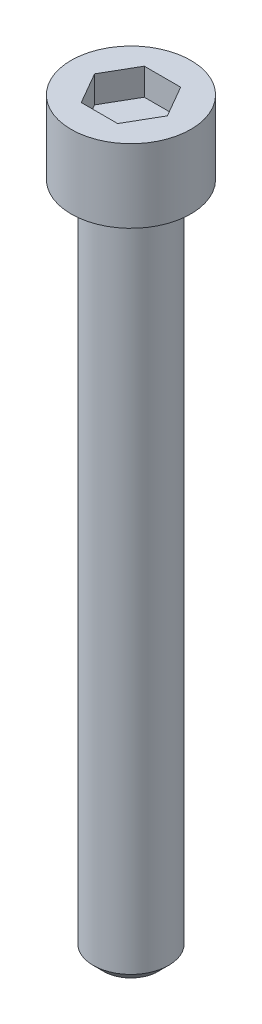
ISO-10303-21;
HEADER;
FILE_DESCRIPTION(('STEP AP214'),'2;1');
FILE_NAME('part.step','',(''),(''),'','','');
FILE_SCHEMA(('AUTOMOTIVE_DESIGN { 1 0 10303 214 1 1 1 1 }'));
ENDSEC;
DATA;
#1=APPLICATION_CONTEXT('core data for automotive mechanical design processes');
#2=APPLICATION_PROTOCOL_DEFINITION('international standard','automotive_design',2000,#1);
#3=PRODUCT_CONTEXT('',#1,'mechanical');
#4=PRODUCT('Part','Part','',(#3));
#5=PRODUCT_RELATED_PRODUCT_CATEGORY('part','',(#4));
#6=PRODUCT_DEFINITION_FORMATION('','',#4);
#7=PRODUCT_DEFINITION_CONTEXT('part definition',#1,'design');
#8=PRODUCT_DEFINITION('design','',#6,#7);
#9=PRODUCT_DEFINITION_SHAPE('','',#8);
#10=(LENGTH_UNIT() NAMED_UNIT(*) SI_UNIT(.MILLI.,.METRE.));
#11=(NAMED_UNIT(*) PLANE_ANGLE_UNIT() SI_UNIT($,.RADIAN.));
#12=(NAMED_UNIT(*) SI_UNIT($,.STERADIAN.) SOLID_ANGLE_UNIT());
#13=UNCERTAINTY_MEASURE_WITH_UNIT(LENGTH_MEASURE(1.E-05),#10,'distance_accuracy_value','');
#14=(GEOMETRIC_REPRESENTATION_CONTEXT(3) GLOBAL_UNCERTAINTY_ASSIGNED_CONTEXT((#13)) GLOBAL_UNIT_ASSIGNED_CONTEXT((#10,
#11,#12)) REPRESENTATION_CONTEXT('',''));
#15=CARTESIAN_POINT('',(0.,0.,0.));
#16=DIRECTION('',(0.,0.,1.));
#17=DIRECTION('',(1.,0.,0.));
#18=AXIS2_PLACEMENT_3D('',#15,#16,#17);
#19=CARTESIAN_POINT('',(0.,2.7686,0.));
#20=DIRECTION('',(0.,-1.,0.));
#21=DIRECTION('',(0.,0.,-1.));
#22=AXIS2_PLACEMENT_3D('',#19,#20,#21);
#23=PLANE('',#22);
#24=DIRECTION('',(-0.5,0.,-0.866025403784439));
#25=VECTOR('',#24,1.);
#26=CARTESIAN_POINT('',(1.3748153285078,2.7686,0.));
#27=LINE('',#26,#25);
#28=CARTESIAN_POINT('',(1.3748153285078,2.7686,0.));
#29=VERTEX_POINT('',#28);
#30=CARTESIAN_POINT('',(0.687407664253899,2.7686,-1.190625));
#31=VERTEX_POINT('',#30);
#32=EDGE_CURVE('E118',#29,#31,#27,.T.);
#33=ORIENTED_EDGE('',*,*,#32,.F.);
#34=DIRECTION('',(0.5,0.,-0.866025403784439));
#35=VECTOR('',#34,1.);
#36=CARTESIAN_POINT('',(0.687407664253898,2.7686,1.190625));
#37=LINE('',#36,#35);
#38=CARTESIAN_POINT('',(0.687407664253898,2.7686,1.190625));
#39=VERTEX_POINT('',#38);
#40=EDGE_CURVE('E44',#39,#29,#37,.T.);
#41=ORIENTED_EDGE('',*,*,#40,.F.);
#42=DIRECTION('',(1.,0.,0.));
#43=VECTOR('',#42,1.);
#44=CARTESIAN_POINT('',(-0.687407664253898,2.7686,1.190625));
#45=LINE('',#44,#43);
#46=CARTESIAN_POINT('',(-0.687407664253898,2.7686,1.190625));
#47=VERTEX_POINT('',#46);
#48=EDGE_CURVE('E127',#47,#39,#45,.T.);
#49=ORIENTED_EDGE('',*,*,#48,.F.);
#50=DIRECTION('',(0.5,0.,0.866025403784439));
#51=VECTOR('',#50,1.);
#52=CARTESIAN_POINT('',(-1.3748153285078,2.7686,0.));
#53=LINE('',#52,#51);
#54=CARTESIAN_POINT('',(-1.3748153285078,2.7686,0.));
#55=VERTEX_POINT('',#54);
#56=EDGE_CURVE('E125',#55,#47,#53,.T.);
#57=ORIENTED_EDGE('',*,*,#56,.F.);
#58=DIRECTION('',(-0.5,0.,0.866025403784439));
#59=VECTOR('',#58,1.);
#60=CARTESIAN_POINT('',(-0.687407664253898,2.7686,-1.190625));
#61=LINE('',#60,#59);
#62=CARTESIAN_POINT('',(-0.687407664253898,2.7686,-1.190625));
#63=VERTEX_POINT('',#62);
#64=EDGE_CURVE('E92',#63,#55,#61,.T.);
#65=ORIENTED_EDGE('',*,*,#64,.F.);
#66=DIRECTION('',(-1.,0.,0.));
#67=VECTOR('',#66,1.);
#68=CARTESIAN_POINT('',(0.687407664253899,2.7686,-1.190625));
#69=LINE('',#68,#67);
#70=EDGE_CURVE('E121',#31,#63,#69,.T.);
#71=ORIENTED_EDGE('',*,*,#70,.F.);
#72=EDGE_LOOP('',(#33,#41,#49,#57,#65,#71));
#73=FACE_BOUND('',#72,.T.);
#74=CARTESIAN_POINT('',(0.,2.7686,0.));
#75=DIRECTION('',(0.,1.,0.));
#76=DIRECTION('',(0.,0.,1.));
#77=AXIS2_PLACEMENT_3D('',#74,#75,#76);
#78=CIRCLE('',#77,2.2606);
#79=CARTESIAN_POINT('',(0.,2.7686,2.2606));
#80=VERTEX_POINT('',#79);
#81=EDGE_CURVE('E11',#80,#80,#78,.T.);
#82=ORIENTED_EDGE('',*,*,#81,.T.);
#83=EDGE_LOOP('',(#82));
#84=FACE_BOUND('',#83,.T.);
#85=ADVANCED_FACE('F30',(#73,#84),#23,.F.);
#86=CARTESIAN_POINT('',(0.,17.272,0.));
#87=DIRECTION('',(0.,1.,0.));
#88=DIRECTION('',(0.,0.,1.));
#89=AXIS2_PLACEMENT_3D('',#86,#87,#88);
#90=CYLINDRICAL_SURFACE('',#89,2.2606);
#91=ORIENTED_EDGE('',*,*,#81,.F.);
#92=EDGE_LOOP('',(#91));
#93=FACE_BOUND('',#92,.T.);
#94=CARTESIAN_POINT('',(0.,0.,0.));
#95=DIRECTION('',(0.,1.,0.));
#96=DIRECTION('',(0.,0.,1.));
#97=AXIS2_PLACEMENT_3D('',#94,#95,#96);
#98=CIRCLE('',#97,2.2606);
#99=CARTESIAN_POINT('',(0.,0.,2.2606));
#100=VERTEX_POINT('',#99);
#101=EDGE_CURVE('E37',#100,#100,#98,.T.);
#102=ORIENTED_EDGE('',*,*,#101,.T.);
#103=EDGE_LOOP('',(#102));
#104=FACE_BOUND('',#103,.T.);
#105=ADVANCED_FACE('F147',(#93,#104),#90,.T.);
#106=CARTESIAN_POINT('',(2.2606,0.,0.));
#107=DIRECTION('',(0.,1.,0.));
#108=DIRECTION('',(0.,0.,1.));
#109=AXIS2_PLACEMENT_3D('',#106,#107,#108);
#110=PLANE('',#109);
#111=ORIENTED_EDGE('',*,*,#101,.F.);
#112=EDGE_LOOP('',(#111));
#113=FACE_BOUND('',#112,.T.);
#114=CARTESIAN_POINT('',(0.,0.,0.));
#115=DIRECTION('',(0.,1.,0.));
#116=DIRECTION('',(0.,0.,1.));
#117=AXIS2_PLACEMENT_3D('',#114,#115,#116);
#118=CIRCLE('',#117,1.4224);
#119=CARTESIAN_POINT('',(0.,0.,1.4224));
#120=VERTEX_POINT('',#119);
#121=EDGE_CURVE('E142',#120,#120,#118,.T.);
#122=ORIENTED_EDGE('',*,*,#121,.T.);
#123=EDGE_LOOP('',(#122));
#124=FACE_BOUND('',#123,.T.);
#125=ADVANCED_FACE('F149',(#113,#124),#110,.F.);
#126=CARTESIAN_POINT('',(0.,17.272,0.));
#127=DIRECTION('',(0.,1.,0.));
#128=DIRECTION('',(0.,0.,1.));
#129=AXIS2_PLACEMENT_3D('',#126,#127,#128);
#130=CYLINDRICAL_SURFACE('',#129,1.4224);
#131=ORIENTED_EDGE('',*,*,#121,.F.);
#132=EDGE_LOOP('',(#131));
#133=FACE_BOUND('',#132,.T.);
#134=CARTESIAN_POINT('',(0.,-25.003125,0.));
#135=DIRECTION('',(0.,1.,0.));
#136=DIRECTION('',(0.,0.,1.));
#137=AXIS2_PLACEMENT_3D('',#134,#135,#136);
#138=CIRCLE('',#137,1.42240000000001);
#139=CARTESIAN_POINT('',(0.,-25.003125,1.42240000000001));
#140=VERTEX_POINT('',#139);
#141=EDGE_CURVE('E139',#140,#140,#138,.T.);
#142=ORIENTED_EDGE('',*,*,#141,.T.);
#143=EDGE_LOOP('',(#142));
#144=FACE_BOUND('',#143,.T.);
#145=ADVANCED_FACE('F152',(#133,#144),#130,.T.);
#146=CARTESIAN_POINT('',(0.,-25.4,0.));
#147=DIRECTION('',(0.,1.,0.));
#148=DIRECTION('',(0.,0.,1.));
#149=AXIS2_PLACEMENT_3D('',#146,#147,#148);
#150=CONICAL_SURFACE('',#149,1.02552500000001,0.785398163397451);
#151=ORIENTED_EDGE('',*,*,#141,.F.);
#152=EDGE_LOOP('',(#151));
#153=FACE_BOUND('',#152,.T.);
#154=CARTESIAN_POINT('',(0.,-25.4,0.));
#155=DIRECTION('',(0.,1.,0.));
#156=DIRECTION('',(0.,0.,1.));
#157=AXIS2_PLACEMENT_3D('',#154,#155,#156);
#158=CIRCLE('',#157,1.02552500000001);
#159=CARTESIAN_POINT('',(0.,-25.4,1.02552500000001));
#160=VERTEX_POINT('',#159);
#161=EDGE_CURVE('E131',#160,#160,#158,.T.);
#162=ORIENTED_EDGE('',*,*,#161,.T.);
#163=EDGE_LOOP('',(#162));
#164=FACE_BOUND('',#163,.T.);
#165=ADVANCED_FACE('F158',(#153,#164),#150,.T.);
#166=CARTESIAN_POINT('',(1.02552500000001,-25.4,0.));
#167=DIRECTION('',(0.,1.,0.));
#168=DIRECTION('',(0.,0.,1.));
#169=AXIS2_PLACEMENT_3D('',#166,#167,#168);
#170=PLANE('',#169);
#171=ORIENTED_EDGE('',*,*,#161,.F.);
#172=EDGE_LOOP('',(#171));
#173=FACE_BOUND('',#172,.T.);
#174=ADVANCED_FACE('F164',(#173),#170,.F.);
#175=CARTESIAN_POINT('',(0.687407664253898,1.7526,1.190625));
#176=DIRECTION('',(0.866025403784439,0.,0.5));
#177=DIRECTION('',(0.5,0.,-0.866025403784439));
#178=AXIS2_PLACEMENT_3D('',#175,#176,#177);
#179=PLANE('',#178);
#180=ORIENTED_EDGE('',*,*,#40,.T.);
#181=DIRECTION('',(0.,1.,0.));
#182=VECTOR('',#181,1.);
#183=CARTESIAN_POINT('',(1.3748153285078,1.7526,0.));
#184=LINE('',#183,#182);
#185=CARTESIAN_POINT('',(1.3748153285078,1.7526,0.));
#186=VERTEX_POINT('',#185);
#187=EDGE_CURVE('E74',#186,#29,#184,.T.);
#188=ORIENTED_EDGE('',*,*,#187,.F.);
#189=DIRECTION('',(0.5,0.,-0.866025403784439));
#190=VECTOR('',#189,1.);
#191=CARTESIAN_POINT('',(0.687407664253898,1.7526,1.190625));
#192=LINE('',#191,#190);
#193=CARTESIAN_POINT('',(0.687407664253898,1.7526,1.190625));
#194=VERTEX_POINT('',#193);
#195=EDGE_CURVE('E129',#194,#186,#192,.T.);
#196=ORIENTED_EDGE('',*,*,#195,.F.);
#197=DIRECTION('',(0.,1.,0.));
#198=VECTOR('',#197,1.);
#199=CARTESIAN_POINT('',(0.687407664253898,1.7526,1.190625));
#200=LINE('',#199,#198);
#201=EDGE_CURVE('E52',#194,#39,#200,.T.);
#202=ORIENTED_EDGE('',*,*,#201,.T.);
#203=EDGE_LOOP('',(#180,#188,#196,#202));
#204=FACE_BOUND('',#203,.T.);
#205=ADVANCED_FACE('F169',(#204),#179,.F.);
#206=CARTESIAN_POINT('',(-0.687407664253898,1.7526,1.190625));
#207=DIRECTION('',(0.,0.,1.));
#208=DIRECTION('',(1.,0.,0.));
#209=AXIS2_PLACEMENT_3D('',#206,#207,#208);
#210=PLANE('',#209);
#211=ORIENTED_EDGE('',*,*,#48,.T.);
#212=ORIENTED_EDGE('',*,*,#201,.F.);
#213=DIRECTION('',(1.,0.,0.));
#214=VECTOR('',#213,1.);
#215=CARTESIAN_POINT('',(-0.687407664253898,1.7526,1.190625));
#216=LINE('',#215,#214);
#217=CARTESIAN_POINT('',(-0.687407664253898,1.7526,1.190625));
#218=VERTEX_POINT('',#217);
#219=EDGE_CURVE('E104',#218,#194,#216,.T.);
#220=ORIENTED_EDGE('',*,*,#219,.F.);
#221=DIRECTION('',(0.,1.,0.));
#222=VECTOR('',#221,1.);
#223=CARTESIAN_POINT('',(-0.687407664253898,1.7526,1.190625));
#224=LINE('',#223,#222);
#225=EDGE_CURVE('E96',#218,#47,#224,.T.);
#226=ORIENTED_EDGE('',*,*,#225,.T.);
#227=EDGE_LOOP('',(#211,#212,#220,#226));
#228=FACE_BOUND('',#227,.T.);
#229=ADVANCED_FACE('F174',(#228),#210,.F.);
#230=CARTESIAN_POINT('',(-1.3748153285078,1.7526,0.));
#231=DIRECTION('',(-0.866025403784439,0.,0.5));
#232=DIRECTION('',(0.5,0.,0.866025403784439));
#233=AXIS2_PLACEMENT_3D('',#230,#231,#232);
#234=PLANE('',#233);
#235=ORIENTED_EDGE('',*,*,#56,.T.);
#236=ORIENTED_EDGE('',*,*,#225,.F.);
#237=DIRECTION('',(0.5,0.,0.866025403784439));
#238=VECTOR('',#237,1.);
#239=CARTESIAN_POINT('',(-1.3748153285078,1.7526,0.));
#240=LINE('',#239,#238);
#241=CARTESIAN_POINT('',(-1.3748153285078,1.7526,0.));
#242=VERTEX_POINT('',#241);
#243=EDGE_CURVE('E100',#242,#218,#240,.T.);
#244=ORIENTED_EDGE('',*,*,#243,.F.);
#245=DIRECTION('',(0.,1.,0.));
#246=VECTOR('',#245,1.);
#247=CARTESIAN_POINT('',(-1.3748153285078,1.7526,0.));
#248=LINE('',#247,#246);
#249=EDGE_CURVE('E85',#242,#55,#248,.T.);
#250=ORIENTED_EDGE('',*,*,#249,.T.);
#251=EDGE_LOOP('',(#235,#236,#244,#250));
#252=FACE_BOUND('',#251,.T.);
#253=ADVANCED_FACE('F101',(#252),#234,.F.);
#254=CARTESIAN_POINT('',(-0.687407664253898,1.7526,-1.190625));
#255=DIRECTION('',(-0.866025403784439,0.,-0.5));
#256=DIRECTION('',(-0.5,0.,0.866025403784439));
#257=AXIS2_PLACEMENT_3D('',#254,#255,#256);
#258=PLANE('',#257);
#259=ORIENTED_EDGE('',*,*,#64,.T.);
#260=ORIENTED_EDGE('',*,*,#249,.F.);
#261=DIRECTION('',(-0.5,0.,0.866025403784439));
#262=VECTOR('',#261,1.);
#263=CARTESIAN_POINT('',(-0.687407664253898,1.7526,-1.190625));
#264=LINE('',#263,#262);
#265=CARTESIAN_POINT('',(-0.687407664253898,1.7526,-1.190625));
#266=VERTEX_POINT('',#265);
#267=EDGE_CURVE('E89',#266,#242,#264,.T.);
#268=ORIENTED_EDGE('',*,*,#267,.F.);
#269=DIRECTION('',(0.,1.,0.));
#270=VECTOR('',#269,1.);
#271=CARTESIAN_POINT('',(-0.687407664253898,1.7526,-1.190625));
#272=LINE('',#271,#270);
#273=EDGE_CURVE('E97',#266,#63,#272,.T.);
#274=ORIENTED_EDGE('',*,*,#273,.T.);
#275=EDGE_LOOP('',(#259,#260,#268,#274));
#276=FACE_BOUND('',#275,.T.);
#277=ADVANCED_FACE('F87',(#276),#258,.F.);
#278=CARTESIAN_POINT('',(0.687407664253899,1.7526,-1.190625));
#279=DIRECTION('',(0.,0.,-1.));
#280=DIRECTION('',(-1.,0.,0.));
#281=AXIS2_PLACEMENT_3D('',#278,#279,#280);
#282=PLANE('',#281);
#283=ORIENTED_EDGE('',*,*,#70,.T.);
#284=ORIENTED_EDGE('',*,*,#273,.F.);
#285=DIRECTION('',(-1.,0.,0.));
#286=VECTOR('',#285,1.);
#287=CARTESIAN_POINT('',(0.687407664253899,1.7526,-1.190625));
#288=LINE('',#287,#286);
#289=CARTESIAN_POINT('',(0.687407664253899,1.7526,-1.190625));
#290=VERTEX_POINT('',#289);
#291=EDGE_CURVE('E110',#290,#266,#288,.T.);
#292=ORIENTED_EDGE('',*,*,#291,.F.);
#293=DIRECTION('',(0.,1.,0.));
#294=VECTOR('',#293,1.);
#295=CARTESIAN_POINT('',(0.687407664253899,1.7526,-1.190625));
#296=LINE('',#295,#294);
#297=EDGE_CURVE('E134',#290,#31,#296,.T.);
#298=ORIENTED_EDGE('',*,*,#297,.T.);
#299=EDGE_LOOP('',(#283,#284,#292,#298));
#300=FACE_BOUND('',#299,.T.);
#301=ADVANCED_FACE('F200',(#300),#282,.F.);
#302=CARTESIAN_POINT('',(1.3748153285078,1.7526,0.));
#303=DIRECTION('',(0.866025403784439,0.,-0.5));
#304=DIRECTION('',(-0.5,0.,-0.866025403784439));
#305=AXIS2_PLACEMENT_3D('',#302,#303,#304);
#306=PLANE('',#305);
#307=ORIENTED_EDGE('',*,*,#32,.T.);
#308=ORIENTED_EDGE('',*,*,#297,.F.);
#309=DIRECTION('',(-0.5,0.,-0.866025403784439));
#310=VECTOR('',#309,1.);
#311=CARTESIAN_POINT('',(1.3748153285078,1.7526,0.));
#312=LINE('',#311,#310);
#313=EDGE_CURVE('E112',#186,#290,#312,.T.);
#314=ORIENTED_EDGE('',*,*,#313,.F.);
#315=ORIENTED_EDGE('',*,*,#187,.T.);
#316=EDGE_LOOP('',(#307,#308,#314,#315));
#317=FACE_BOUND('',#316,.T.);
#318=ADVANCED_FACE('F188',(#317),#306,.F.);
#319=CARTESIAN_POINT('',(2.06222299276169,1.7526,-1.190625));
#320=DIRECTION('',(0.,1.,0.));
#321=DIRECTION('',(0.,0.,1.));
#322=AXIS2_PLACEMENT_3D('',#319,#320,#321);
#323=PLANE('',#322);
#324=ORIENTED_EDGE('',*,*,#195,.T.);
#325=ORIENTED_EDGE('',*,*,#313,.T.);
#326=ORIENTED_EDGE('',*,*,#291,.T.);
#327=ORIENTED_EDGE('',*,*,#267,.T.);
#328=ORIENTED_EDGE('',*,*,#243,.T.);
#329=ORIENTED_EDGE('',*,*,#219,.T.);
#330=EDGE_LOOP('',(#324,#325,#326,#327,#328,#329));
#331=FACE_BOUND('',#330,.T.);
#332=ADVANCED_FACE('F107',(#331),#323,.T.);
#333=CLOSED_SHELL('',(#85,#105,#125,#145,#165,#174,#205,#229,#253,#277,#301,#318,#332));
#334=MANIFOLD_SOLID_BREP('B2',#333);
#335=ADVANCED_BREP_SHAPE_REPRESENTATION('',(#18,#334),#14);
#336=SHAPE_DEFINITION_REPRESENTATION(#9,#335);
ENDSEC;
END-ISO-10303-21;
